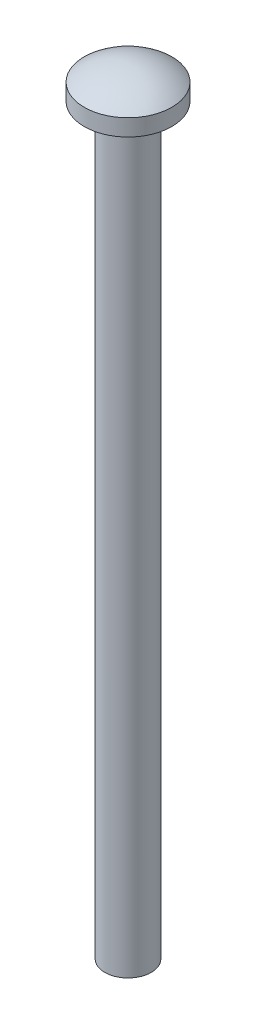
ISO-10303-21;
HEADER;
FILE_DESCRIPTION(('STEP AP214'),'2;1');
FILE_NAME('part.step','',(''),(''),'','','');
FILE_SCHEMA(('AUTOMOTIVE_DESIGN { 1 0 10303 214 1 1 1 1 }'));
ENDSEC;
DATA;
#1=APPLICATION_CONTEXT('core data for automotive mechanical design processes');
#2=APPLICATION_PROTOCOL_DEFINITION('international standard','automotive_design',2000,#1);
#3=PRODUCT_CONTEXT('',#1,'mechanical');
#4=PRODUCT('Part','Part','',(#3));
#5=PRODUCT_RELATED_PRODUCT_CATEGORY('part','',(#4));
#6=PRODUCT_DEFINITION_FORMATION('','',#4);
#7=PRODUCT_DEFINITION_CONTEXT('part definition',#1,'design');
#8=PRODUCT_DEFINITION('design','',#6,#7);
#9=PRODUCT_DEFINITION_SHAPE('','',#8);
#10=(LENGTH_UNIT() NAMED_UNIT(*) SI_UNIT(.MILLI.,.METRE.));
#11=(NAMED_UNIT(*) PLANE_ANGLE_UNIT() SI_UNIT($,.RADIAN.));
#12=(NAMED_UNIT(*) SI_UNIT($,.STERADIAN.) SOLID_ANGLE_UNIT());
#13=UNCERTAINTY_MEASURE_WITH_UNIT(LENGTH_MEASURE(1.E-05),#10,'distance_accuracy_value','');
#14=(GEOMETRIC_REPRESENTATION_CONTEXT(3) GLOBAL_UNCERTAINTY_ASSIGNED_CONTEXT((#13)) GLOBAL_UNIT_ASSIGNED_CONTEXT((#10,
#11,#12)) REPRESENTATION_CONTEXT('',''));
#15=CARTESIAN_POINT('',(0.,0.,0.));
#16=DIRECTION('',(0.,0.,1.));
#17=DIRECTION('',(1.,0.,0.));
#18=AXIS2_PLACEMENT_3D('',#15,#16,#17);
#19=CARTESIAN_POINT('',(0.,0.,0.));
#20=DIRECTION('',(0.,-1.,0.));
#21=DIRECTION('',(1.,0.,0.));
#22=AXIS2_PLACEMENT_3D('',#19,#20,#21);
#23=PLANE('',#22);
#24=CARTESIAN_POINT('',(0.,0.,0.));
#25=DIRECTION('',(0.,-1.,0.));
#26=DIRECTION('',(1.,0.,0.));
#27=AXIS2_PLACEMENT_3D('',#24,#25,#26);
#28=CIRCLE('',#27,3.175);
#29=CARTESIAN_POINT('',(3.175,0.,0.));
#30=VERTEX_POINT('',#29);
#31=EDGE_CURVE('E10',#30,#30,#28,.T.);
#32=ORIENTED_EDGE('',*,*,#31,.F.);
#33=EDGE_LOOP('',(#32));
#34=FACE_BOUND('',#33,.T.);
#35=CARTESIAN_POINT('',(0.,0.,0.));
#36=DIRECTION('',(0.,-1.,0.));
#37=DIRECTION('',(1.,0.,0.));
#38=AXIS2_PLACEMENT_3D('',#35,#36,#37);
#39=CIRCLE('',#38,5.9944);
#40=CARTESIAN_POINT('',(5.9944,0.,0.));
#41=VERTEX_POINT('',#40);
#42=EDGE_CURVE('E43',#41,#41,#39,.T.);
#43=ORIENTED_EDGE('',*,*,#42,.T.);
#44=EDGE_LOOP('',(#43));
#45=FACE_BOUND('',#44,.T.);
#46=ADVANCED_FACE('F33',(#34,#45),#23,.T.);
#47=CARTESIAN_POINT('',(0.,-4.95613764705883,0.));
#48=DIRECTION('',(0.,-1.,0.));
#49=DIRECTION('',(1.,0.,0.));
#50=AXIS2_PLACEMENT_3D('',#47,#48,#49);
#51=SPHERICAL_SURFACE('',#50,9.40113764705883);
#52=CARTESIAN_POINT('',(0.,2.286,0.));
#53=DIRECTION('',(0.,-1.,0.));
#54=DIRECTION('',(1.,0.,0.));
#55=AXIS2_PLACEMENT_3D('',#52,#53,#54);
#56=CIRCLE('',#55,5.9944);
#57=CARTESIAN_POINT('',(5.9944,2.286,0.));
#58=VERTEX_POINT('',#57);
#59=EDGE_CURVE('E39',#58,#58,#56,.T.);
#60=ORIENTED_EDGE('',*,*,#59,.F.);
#61=EDGE_LOOP('',(#60));
#62=FACE_BOUND('',#61,.T.);
#63=ADVANCED_FACE('F64',(#62),#51,.T.);
#64=CARTESIAN_POINT('',(0.,0.,0.));
#65=DIRECTION('',(0.,-1.,0.));
#66=DIRECTION('',(1.,0.,0.));
#67=AXIS2_PLACEMENT_3D('',#64,#65,#66);
#68=CYLINDRICAL_SURFACE('',#67,5.9944);
#69=ORIENTED_EDGE('',*,*,#59,.T.);
#70=EDGE_LOOP('',(#69));
#71=FACE_BOUND('',#70,.T.);
#72=ORIENTED_EDGE('',*,*,#42,.F.);
#73=EDGE_LOOP('',(#72));
#74=FACE_BOUND('',#73,.T.);
#75=ADVANCED_FACE('F61',(#71,#74),#68,.T.);
#76=CARTESIAN_POINT('',(0.,-101.6,0.));
#77=DIRECTION('',(0.,1.,0.));
#78=DIRECTION('',(0.,0.,1.));
#79=AXIS2_PLACEMENT_3D('',#76,#77,#78);
#80=CYLINDRICAL_SURFACE('',#79,3.175);
#81=CARTESIAN_POINT('',(0.,-101.6,0.));
#82=DIRECTION('',(0.,1.,0.));
#83=DIRECTION('',(0.,0.,1.));
#84=AXIS2_PLACEMENT_3D('',#81,#82,#83);
#85=CIRCLE('',#84,3.175);
#86=CARTESIAN_POINT('',(0.,-101.6,3.175));
#87=VERTEX_POINT('',#86);
#88=EDGE_CURVE('E47',#87,#87,#85,.T.);
#89=ORIENTED_EDGE('',*,*,#88,.T.);
#90=EDGE_LOOP('',(#89));
#91=FACE_BOUND('',#90,.T.);
#92=ORIENTED_EDGE('',*,*,#31,.T.);
#93=EDGE_LOOP('',(#92));
#94=FACE_BOUND('',#93,.T.);
#95=ADVANCED_FACE('F53',(#91,#94),#80,.T.);
#96=CARTESIAN_POINT('',(0.,-101.6,0.));
#97=DIRECTION('',(0.,1.,0.));
#98=DIRECTION('',(0.,0.,1.));
#99=AXIS2_PLACEMENT_3D('',#96,#97,#98);
#100=PLANE('',#99);
#101=ORIENTED_EDGE('',*,*,#88,.F.);
#102=EDGE_LOOP('',(#101));
#103=FACE_BOUND('',#102,.T.);
#104=ADVANCED_FACE('F55',(#103),#100,.F.);
#105=CLOSED_SHELL('',(#46,#63,#75,#95,#104));
#106=MANIFOLD_SOLID_BREP('B2',#105);
#107=ADVANCED_BREP_SHAPE_REPRESENTATION('',(#18,#106),#14);
#108=SHAPE_DEFINITION_REPRESENTATION(#9,#107);
ENDSEC;
END-ISO-10303-21;
